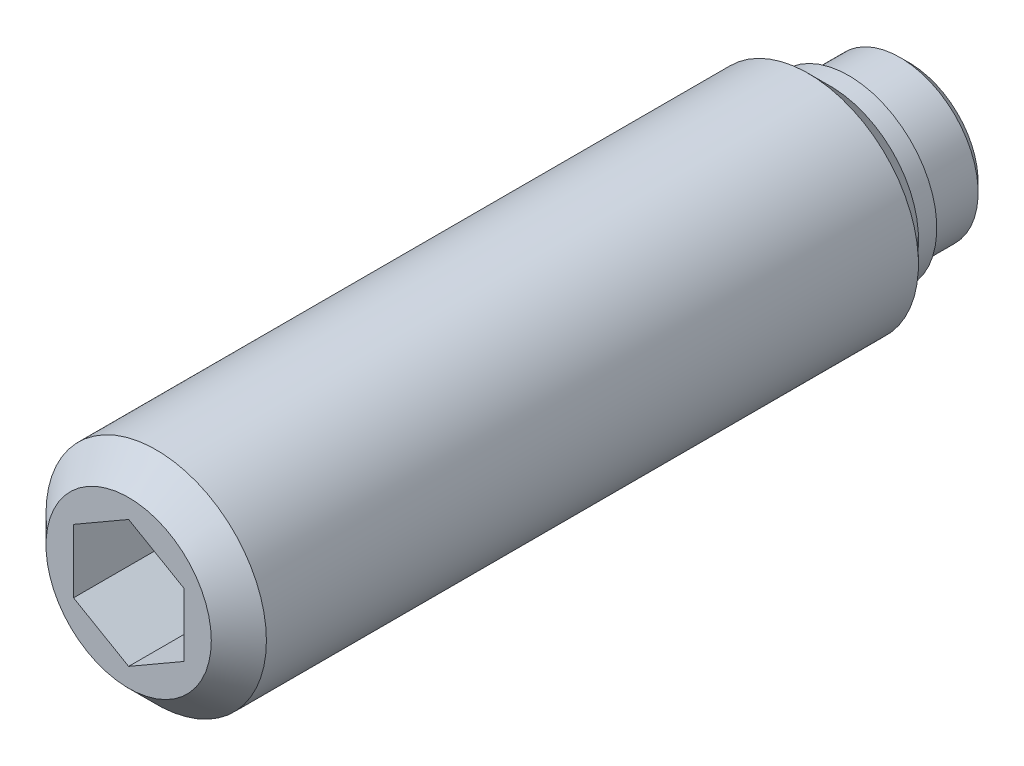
ISO-10303-21;
HEADER;
FILE_DESCRIPTION(('STEP AP214'),'2;1');
FILE_NAME('part.step','',(''),(''),'','','');
FILE_SCHEMA(('AUTOMOTIVE_DESIGN { 1 0 10303 214 1 1 1 1 }'));
ENDSEC;
DATA;
#1=APPLICATION_CONTEXT('core data for automotive mechanical design processes');
#2=APPLICATION_PROTOCOL_DEFINITION('international standard','automotive_design',2000,#1);
#3=PRODUCT_CONTEXT('',#1,'mechanical');
#4=PRODUCT('Part','Part','',(#3));
#5=PRODUCT_RELATED_PRODUCT_CATEGORY('part','',(#4));
#6=PRODUCT_DEFINITION_FORMATION('','',#4);
#7=PRODUCT_DEFINITION_CONTEXT('part definition',#1,'design');
#8=PRODUCT_DEFINITION('design','',#6,#7);
#9=PRODUCT_DEFINITION_SHAPE('','',#8);
#10=(LENGTH_UNIT() NAMED_UNIT(*) SI_UNIT(.MILLI.,.METRE.));
#11=(NAMED_UNIT(*) PLANE_ANGLE_UNIT() SI_UNIT($,.RADIAN.));
#12=(NAMED_UNIT(*) SI_UNIT($,.STERADIAN.) SOLID_ANGLE_UNIT());
#13=UNCERTAINTY_MEASURE_WITH_UNIT(LENGTH_MEASURE(1.E-05),#10,'distance_accuracy_value','');
#14=(GEOMETRIC_REPRESENTATION_CONTEXT(3) GLOBAL_UNCERTAINTY_ASSIGNED_CONTEXT((#13)) GLOBAL_UNIT_ASSIGNED_CONTEXT((#10,
#11,#12)) REPRESENTATION_CONTEXT('',''));
#15=CARTESIAN_POINT('',(0.,0.,0.));
#16=DIRECTION('',(0.,0.,1.));
#17=DIRECTION('',(1.,0.,0.));
#18=AXIS2_PLACEMENT_3D('',#15,#16,#17);
#19=CARTESIAN_POINT('',(0.,0.,3.3));
#20=DIRECTION('',(0.,0.,-1.));
#21=DIRECTION('',(-1.,0.,0.));
#22=AXIS2_PLACEMENT_3D('',#19,#20,#21);
#23=CYLINDRICAL_SURFACE('',#22,6.);
#24=CARTESIAN_POINT('',(0.,0.,5.5));
#25=DIRECTION('',(0.,0.,-1.));
#26=DIRECTION('',(-1.,0.,0.));
#27=AXIS2_PLACEMENT_3D('',#24,#25,#26);
#28=CIRCLE('',#27,6.);
#29=CARTESIAN_POINT('',(-6.,0.,5.5));
#30=VERTEX_POINT('',#29);
#31=EDGE_CURVE('E9',#30,#30,#28,.T.);
#32=ORIENTED_EDGE('',*,*,#31,.F.);
#33=EDGE_LOOP('',(#32));
#34=FACE_BOUND('',#33,.T.);
#35=CARTESIAN_POINT('',(0.,0.,41.));
#36=DIRECTION('',(0.,0.,1.));
#37=DIRECTION('',(1.,0.,0.));
#38=AXIS2_PLACEMENT_3D('',#35,#36,#37);
#39=CIRCLE('',#38,6.);
#40=CARTESIAN_POINT('',(6.,0.,41.));
#41=VERTEX_POINT('',#40);
#42=EDGE_CURVE('E123',#41,#41,#39,.T.);
#43=ORIENTED_EDGE('',*,*,#42,.F.);
#44=EDGE_LOOP('',(#43));
#45=FACE_BOUND('',#44,.T.);
#46=ADVANCED_FACE('F14',(#34,#45),#23,.T.);
#47=CARTESIAN_POINT('',(0.,0.,5.5));
#48=DIRECTION('',(0.,0.,1.));
#49=DIRECTION('',(1.,0.,0.));
#50=AXIS2_PLACEMENT_3D('',#47,#48,#49);
#51=CONICAL_SURFACE('',#50,6.,0.785398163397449);
#52=ORIENTED_EDGE('',*,*,#31,.T.);
#53=EDGE_LOOP('',(#52));
#54=FACE_BOUND('',#53,.T.);
#55=CARTESIAN_POINT('',(0.,0.,4.3));
#56=DIRECTION('',(0.,0.,-1.));
#57=DIRECTION('',(-1.,0.,0.));
#58=AXIS2_PLACEMENT_3D('',#55,#56,#57);
#59=CIRCLE('',#58,4.8);
#60=CARTESIAN_POINT('',(-4.8,0.,4.3));
#61=VERTEX_POINT('',#60);
#62=EDGE_CURVE('E21',#61,#61,#59,.T.);
#63=ORIENTED_EDGE('',*,*,#62,.F.);
#64=EDGE_LOOP('',(#63));
#65=FACE_BOUND('',#64,.T.);
#66=ADVANCED_FACE('F143',(#54,#65),#51,.T.);
#67=CARTESIAN_POINT('',(0.,0.,3.3));
#68=DIRECTION('',(0.,0.,-1.));
#69=DIRECTION('',(-1.,0.,0.));
#70=AXIS2_PLACEMENT_3D('',#67,#68,#69);
#71=CYLINDRICAL_SURFACE('',#70,4.8);
#72=ORIENTED_EDGE('',*,*,#62,.T.);
#73=EDGE_LOOP('',(#72));
#74=FACE_BOUND('',#73,.T.);
#75=CARTESIAN_POINT('',(0.,0.,3.3));
#76=DIRECTION('',(0.,0.,-1.));
#77=DIRECTION('',(-1.,0.,0.));
#78=AXIS2_PLACEMENT_3D('',#75,#76,#77);
#79=CIRCLE('',#78,4.8);
#80=CARTESIAN_POINT('',(-4.8,0.,3.3));
#81=VERTEX_POINT('',#80);
#82=EDGE_CURVE('E135',#81,#81,#79,.T.);
#83=ORIENTED_EDGE('',*,*,#82,.F.);
#84=EDGE_LOOP('',(#83));
#85=FACE_BOUND('',#84,.T.);
#86=ADVANCED_FACE('F140',(#74,#85),#71,.T.);
#87=CARTESIAN_POINT('',(0.,4.8,3.3));
#88=DIRECTION('',(0.,0.,1.));
#89=DIRECTION('',(1.,0.,0.));
#90=AXIS2_PLACEMENT_3D('',#87,#88,#89);
#91=PLANE('',#90);
#92=ORIENTED_EDGE('',*,*,#82,.T.);
#93=EDGE_LOOP('',(#92));
#94=FACE_BOUND('',#93,.T.);
#95=CARTESIAN_POINT('',(0.,0.,3.3));
#96=DIRECTION('',(0.,0.,-1.));
#97=DIRECTION('',(-1.,0.,0.));
#98=AXIS2_PLACEMENT_3D('',#95,#96,#97);
#99=CIRCLE('',#98,4.25);
#100=CARTESIAN_POINT('',(-4.25,0.,3.3));
#101=VERTEX_POINT('',#100);
#102=EDGE_CURVE('E132',#101,#101,#99,.T.);
#103=ORIENTED_EDGE('',*,*,#102,.F.);
#104=EDGE_LOOP('',(#103));
#105=FACE_BOUND('',#104,.T.);
#106=ADVANCED_FACE('F151',(#94,#105),#91,.F.);
#107=CARTESIAN_POINT('',(0.,0.,0.));
#108=DIRECTION('',(0.,0.,-1.));
#109=DIRECTION('',(-1.,0.,0.));
#110=AXIS2_PLACEMENT_3D('',#107,#108,#109);
#111=CYLINDRICAL_SURFACE('',#110,4.25);
#112=CARTESIAN_POINT('',(0.,0.,0.5));
#113=DIRECTION('',(0.,0.,-1.));
#114=DIRECTION('',(-1.,0.,0.));
#115=AXIS2_PLACEMENT_3D('',#112,#113,#114);
#116=CIRCLE('',#115,4.25);
#117=CARTESIAN_POINT('',(-4.25,0.,0.5));
#118=VERTEX_POINT('',#117);
#119=EDGE_CURVE('E129',#118,#118,#116,.T.);
#120=ORIENTED_EDGE('',*,*,#119,.F.);
#121=EDGE_LOOP('',(#120));
#122=FACE_BOUND('',#121,.T.);
#123=ORIENTED_EDGE('',*,*,#102,.T.);
#124=EDGE_LOOP('',(#123));
#125=FACE_BOUND('',#124,.T.);
#126=ADVANCED_FACE('F157',(#122,#125),#111,.T.);
#127=CARTESIAN_POINT('',(0.,0.,0.5));
#128=DIRECTION('',(0.,0.,1.));
#129=DIRECTION('',(1.,0.,0.));
#130=AXIS2_PLACEMENT_3D('',#127,#128,#129);
#131=CONICAL_SURFACE('',#130,4.25,0.785398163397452);
#132=CARTESIAN_POINT('',(0.,0.,0.));
#133=DIRECTION('',(0.,0.,-1.));
#134=DIRECTION('',(-1.,0.,0.));
#135=AXIS2_PLACEMENT_3D('',#132,#133,#134);
#136=CIRCLE('',#135,3.75);
#137=CARTESIAN_POINT('',(-3.75,0.,0.));
#138=VERTEX_POINT('',#137);
#139=EDGE_CURVE('E126',#138,#138,#136,.T.);
#140=ORIENTED_EDGE('',*,*,#139,.F.);
#141=EDGE_LOOP('',(#140));
#142=FACE_BOUND('',#141,.T.);
#143=ORIENTED_EDGE('',*,*,#119,.T.);
#144=EDGE_LOOP('',(#143));
#145=FACE_BOUND('',#144,.T.);
#146=ADVANCED_FACE('F161',(#142,#145),#131,.T.);
#147=CARTESIAN_POINT('',(0.,3.75,0.));
#148=DIRECTION('',(0.,0.,1.));
#149=DIRECTION('',(1.,0.,0.));
#150=AXIS2_PLACEMENT_3D('',#147,#148,#149);
#151=PLANE('',#150);
#152=ORIENTED_EDGE('',*,*,#139,.T.);
#153=EDGE_LOOP('',(#152));
#154=FACE_BOUND('',#153,.T.);
#155=ADVANCED_FACE('F165',(#154),#151,.F.);
#156=CARTESIAN_POINT('',(0.,0.,42.5));
#157=DIRECTION('',(0.,0.,-1.));
#158=DIRECTION('',(-1.,0.,0.));
#159=AXIS2_PLACEMENT_3D('',#156,#157,#158);
#160=CONICAL_SURFACE('',#159,4.5,0.78539816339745);
#161=ORIENTED_EDGE('',*,*,#42,.T.);
#162=EDGE_LOOP('',(#161));
#163=FACE_BOUND('',#162,.T.);
#164=CARTESIAN_POINT('',(0.,0.,42.5));
#165=DIRECTION('',(0.,0.,1.));
#166=DIRECTION('',(1.,0.,0.));
#167=AXIS2_PLACEMENT_3D('',#164,#165,#166);
#168=CIRCLE('',#167,4.5);
#169=CARTESIAN_POINT('',(4.5,0.,42.5));
#170=VERTEX_POINT('',#169);
#171=EDGE_CURVE('E115',#170,#170,#168,.T.);
#172=ORIENTED_EDGE('',*,*,#171,.F.);
#173=EDGE_LOOP('',(#172));
#174=FACE_BOUND('',#173,.T.);
#175=ADVANCED_FACE('F169',(#163,#174),#160,.T.);
#176=CARTESIAN_POINT('',(0.,-4.5,42.5));
#177=DIRECTION('',(0.,0.,1.));
#178=DIRECTION('',(1.,0.,0.));
#179=AXIS2_PLACEMENT_3D('',#176,#177,#178);
#180=PLANE('',#179);
#181=DIRECTION('',(0.866025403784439,-0.5,0.));
#182=VECTOR('',#181,1.);
#183=CARTESIAN_POINT('',(-3.,-1.73205080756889,42.5));
#184=LINE('',#183,#182);
#185=CARTESIAN_POINT('',(-3.,-1.73205080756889,42.5));
#186=VERTEX_POINT('',#185);
#187=CARTESIAN_POINT('',(0.,-3.46410161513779,42.5));
#188=VERTEX_POINT('',#187);
#189=EDGE_CURVE('E28',#186,#188,#184,.T.);
#190=ORIENTED_EDGE('',*,*,#189,.F.);
#191=DIRECTION('',(0.,-1.,0.));
#192=VECTOR('',#191,1.);
#193=CARTESIAN_POINT('',(-3.,1.73205080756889,42.5));
#194=LINE('',#193,#192);
#195=CARTESIAN_POINT('',(-3.,1.73205080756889,42.5));
#196=VERTEX_POINT('',#195);
#197=EDGE_CURVE('E111',#196,#186,#194,.T.);
#198=ORIENTED_EDGE('',*,*,#197,.F.);
#199=DIRECTION('',(-0.866025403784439,-0.5,0.));
#200=VECTOR('',#199,1.);
#201=CARTESIAN_POINT('',(0.,3.46410161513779,42.5));
#202=LINE('',#201,#200);
#203=CARTESIAN_POINT('',(0.,3.46410161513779,42.5));
#204=VERTEX_POINT('',#203);
#205=EDGE_CURVE('E109',#204,#196,#202,.T.);
#206=ORIENTED_EDGE('',*,*,#205,.F.);
#207=DIRECTION('',(-0.866025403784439,0.5,0.));
#208=VECTOR('',#207,1.);
#209=CARTESIAN_POINT('',(3.,1.73205080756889,42.5));
#210=LINE('',#209,#208);
#211=CARTESIAN_POINT('',(3.,1.73205080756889,42.5));
#212=VERTEX_POINT('',#211);
#213=EDGE_CURVE('E76',#212,#204,#210,.T.);
#214=ORIENTED_EDGE('',*,*,#213,.F.);
#215=DIRECTION('',(0.,1.,0.));
#216=VECTOR('',#215,1.);
#217=CARTESIAN_POINT('',(3.,-1.73205080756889,42.5));
#218=LINE('',#217,#216);
#219=CARTESIAN_POINT('',(3.,-1.73205080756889,42.5));
#220=VERTEX_POINT('',#219);
#221=EDGE_CURVE('E105',#220,#212,#218,.T.);
#222=ORIENTED_EDGE('',*,*,#221,.F.);
#223=DIRECTION('',(0.866025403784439,0.5,0.));
#224=VECTOR('',#223,1.);
#225=CARTESIAN_POINT('',(0.,-3.46410161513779,42.5));
#226=LINE('',#225,#224);
#227=EDGE_CURVE('E102',#188,#220,#226,.T.);
#228=ORIENTED_EDGE('',*,*,#227,.F.);
#229=EDGE_LOOP('',(#190,#198,#206,#214,#222,#228));
#230=FACE_BOUND('',#229,.T.);
#231=ORIENTED_EDGE('',*,*,#171,.T.);
#232=EDGE_LOOP('',(#231));
#233=FACE_BOUND('',#232,.T.);
#234=ADVANCED_FACE('F173',(#230,#233),#180,.T.);
#235=CARTESIAN_POINT('',(-3.,-1.73205080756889,34.5));
#236=DIRECTION('',(-0.5,-0.866025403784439,0.));
#237=DIRECTION('',(0.866025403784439,-0.5,0.));
#238=AXIS2_PLACEMENT_3D('',#235,#236,#237);
#239=PLANE('',#238);
#240=ORIENTED_EDGE('',*,*,#189,.T.);
#241=DIRECTION('',(0.,0.,1.));
#242=VECTOR('',#241,1.);
#243=CARTESIAN_POINT('',(0.,-3.46410161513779,34.5));
#244=LINE('',#243,#242);
#245=CARTESIAN_POINT('',(0.,-3.46410161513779,34.5));
#246=VERTEX_POINT('',#245);
#247=EDGE_CURVE('E58',#246,#188,#244,.T.);
#248=ORIENTED_EDGE('',*,*,#247,.F.);
#249=DIRECTION('',(0.866025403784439,-0.5,0.));
#250=VECTOR('',#249,1.);
#251=CARTESIAN_POINT('',(-3.,-1.73205080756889,34.5));
#252=LINE('',#251,#250);
#253=CARTESIAN_POINT('',(-3.,-1.73205080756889,34.5));
#254=VERTEX_POINT('',#253);
#255=EDGE_CURVE('E113',#254,#246,#252,.T.);
#256=ORIENTED_EDGE('',*,*,#255,.F.);
#257=DIRECTION('',(0.,0.,1.));
#258=VECTOR('',#257,1.);
#259=CARTESIAN_POINT('',(-3.,-1.73205080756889,34.5));
#260=LINE('',#259,#258);
#261=EDGE_CURVE('E36',#254,#186,#260,.T.);
#262=ORIENTED_EDGE('',*,*,#261,.T.);
#263=EDGE_LOOP('',(#240,#248,#256,#262));
#264=FACE_BOUND('',#263,.T.);
#265=ADVANCED_FACE('F177',(#264),#239,.F.);
#266=CARTESIAN_POINT('',(-3.,1.73205080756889,34.5));
#267=DIRECTION('',(-1.,0.,0.));
#268=DIRECTION('',(0.,0.,1.));
#269=AXIS2_PLACEMENT_3D('',#266,#267,#268);
#270=PLANE('',#269);
#271=ORIENTED_EDGE('',*,*,#197,.T.);
#272=ORIENTED_EDGE('',*,*,#261,.F.);
#273=DIRECTION('',(0.,-1.,0.));
#274=VECTOR('',#273,1.);
#275=CARTESIAN_POINT('',(-3.,1.73205080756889,34.5));
#276=LINE('',#275,#274);
#277=CARTESIAN_POINT('',(-3.,1.73205080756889,34.5));
#278=VERTEX_POINT('',#277);
#279=EDGE_CURVE('E88',#278,#254,#276,.T.);
#280=ORIENTED_EDGE('',*,*,#279,.F.);
#281=DIRECTION('',(0.,0.,1.));
#282=VECTOR('',#281,1.);
#283=CARTESIAN_POINT('',(-3.,1.73205080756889,34.5));
#284=LINE('',#283,#282);
#285=EDGE_CURVE('E80',#278,#196,#284,.T.);
#286=ORIENTED_EDGE('',*,*,#285,.T.);
#287=EDGE_LOOP('',(#271,#272,#280,#286));
#288=FACE_BOUND('',#287,.T.);
#289=ADVANCED_FACE('F181',(#288),#270,.F.);
#290=CARTESIAN_POINT('',(0.,3.46410161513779,34.5));
#291=DIRECTION('',(-0.5,0.866025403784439,0.));
#292=DIRECTION('',(-0.866025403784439,-0.5,0.));
#293=AXIS2_PLACEMENT_3D('',#290,#291,#292);
#294=PLANE('',#293);
#295=ORIENTED_EDGE('',*,*,#205,.T.);
#296=ORIENTED_EDGE('',*,*,#285,.F.);
#297=DIRECTION('',(-0.866025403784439,-0.5,0.));
#298=VECTOR('',#297,1.);
#299=CARTESIAN_POINT('',(0.,3.46410161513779,34.5));
#300=LINE('',#299,#298);
#301=CARTESIAN_POINT('',(0.,3.46410161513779,34.5));
#302=VERTEX_POINT('',#301);
#303=EDGE_CURVE('E84',#302,#278,#300,.T.);
#304=ORIENTED_EDGE('',*,*,#303,.F.);
#305=DIRECTION('',(0.,0.,1.));
#306=VECTOR('',#305,1.);
#307=CARTESIAN_POINT('',(0.,3.46410161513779,34.5));
#308=LINE('',#307,#306);
#309=EDGE_CURVE('E69',#302,#204,#308,.T.);
#310=ORIENTED_EDGE('',*,*,#309,.T.);
#311=EDGE_LOOP('',(#295,#296,#304,#310));
#312=FACE_BOUND('',#311,.T.);
#313=ADVANCED_FACE('F85',(#312),#294,.F.);
#314=CARTESIAN_POINT('',(3.,1.73205080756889,34.5));
#315=DIRECTION('',(0.5,0.866025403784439,0.));
#316=DIRECTION('',(-0.866025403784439,0.5,0.));
#317=AXIS2_PLACEMENT_3D('',#314,#315,#316);
#318=PLANE('',#317);
#319=ORIENTED_EDGE('',*,*,#213,.T.);
#320=ORIENTED_EDGE('',*,*,#309,.F.);
#321=DIRECTION('',(-0.866025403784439,0.5,0.));
#322=VECTOR('',#321,1.);
#323=CARTESIAN_POINT('',(3.,1.73205080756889,34.5));
#324=LINE('',#323,#322);
#325=CARTESIAN_POINT('',(3.,1.73205080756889,34.5));
#326=VERTEX_POINT('',#325);
#327=EDGE_CURVE('E73',#326,#302,#324,.T.);
#328=ORIENTED_EDGE('',*,*,#327,.F.);
#329=DIRECTION('',(0.,0.,1.));
#330=VECTOR('',#329,1.);
#331=CARTESIAN_POINT('',(3.,1.73205080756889,34.5));
#332=LINE('',#331,#330);
#333=EDGE_CURVE('E81',#326,#212,#332,.T.);
#334=ORIENTED_EDGE('',*,*,#333,.T.);
#335=EDGE_LOOP('',(#319,#320,#328,#334));
#336=FACE_BOUND('',#335,.T.);
#337=ADVANCED_FACE('F71',(#336),#318,.F.);
#338=CARTESIAN_POINT('',(3.,-1.73205080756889,34.5));
#339=DIRECTION('',(1.,0.,0.));
#340=DIRECTION('',(0.,0.,-1.));
#341=AXIS2_PLACEMENT_3D('',#338,#339,#340);
#342=PLANE('',#341);
#343=ORIENTED_EDGE('',*,*,#221,.T.);
#344=ORIENTED_EDGE('',*,*,#333,.F.);
#345=DIRECTION('',(0.,1.,0.));
#346=VECTOR('',#345,1.);
#347=CARTESIAN_POINT('',(3.,-1.73205080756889,34.5));
#348=LINE('',#347,#346);
#349=CARTESIAN_POINT('',(3.,-1.73205080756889,34.5));
#350=VERTEX_POINT('',#349);
#351=EDGE_CURVE('E94',#350,#326,#348,.T.);
#352=ORIENTED_EDGE('',*,*,#351,.F.);
#353=DIRECTION('',(0.,0.,1.));
#354=VECTOR('',#353,1.);
#355=CARTESIAN_POINT('',(3.,-1.73205080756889,34.5));
#356=LINE('',#355,#354);
#357=EDGE_CURVE('E118',#350,#220,#356,.T.);
#358=ORIENTED_EDGE('',*,*,#357,.T.);
#359=EDGE_LOOP('',(#343,#344,#352,#358));
#360=FACE_BOUND('',#359,.T.);
#361=ADVANCED_FACE('F185',(#360),#342,.F.);
#362=CARTESIAN_POINT('',(0.,-3.46410161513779,34.5));
#363=DIRECTION('',(0.5,-0.866025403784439,0.));
#364=DIRECTION('',(0.866025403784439,0.5,0.));
#365=AXIS2_PLACEMENT_3D('',#362,#363,#364);
#366=PLANE('',#365);
#367=ORIENTED_EDGE('',*,*,#227,.T.);
#368=ORIENTED_EDGE('',*,*,#357,.F.);
#369=DIRECTION('',(0.866025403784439,0.5,0.));
#370=VECTOR('',#369,1.);
#371=CARTESIAN_POINT('',(0.,-3.46410161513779,34.5));
#372=LINE('',#371,#370);
#373=EDGE_CURVE('E96',#246,#350,#372,.T.);
#374=ORIENTED_EDGE('',*,*,#373,.F.);
#375=ORIENTED_EDGE('',*,*,#247,.T.);
#376=EDGE_LOOP('',(#367,#368,#374,#375));
#377=FACE_BOUND('',#376,.T.);
#378=ADVANCED_FACE('F182',(#377),#366,.F.);
#379=CARTESIAN_POINT('',(0.,0.,34.5));
#380=DIRECTION('',(0.,0.,1.));
#381=DIRECTION('',(1.,0.,0.));
#382=AXIS2_PLACEMENT_3D('',#379,#380,#381);
#383=PLANE('',#382);
#384=ORIENTED_EDGE('',*,*,#255,.T.);
#385=ORIENTED_EDGE('',*,*,#373,.T.);
#386=ORIENTED_EDGE('',*,*,#351,.T.);
#387=ORIENTED_EDGE('',*,*,#327,.T.);
#388=ORIENTED_EDGE('',*,*,#303,.T.);
#389=ORIENTED_EDGE('',*,*,#279,.T.);
#390=EDGE_LOOP('',(#384,#385,#386,#387,#388,#389));
#391=FACE_BOUND('',#390,.T.);
#392=ADVANCED_FACE('F91',(#391),#383,.T.);
#393=CLOSED_SHELL('',(#46,#66,#86,#106,#126,#146,#155,#175,#234,#265,#289,#313,#337,#361,#378,#392));
#394=MANIFOLD_SOLID_BREP('B1',#393);
#395=ADVANCED_BREP_SHAPE_REPRESENTATION('',(#18,#394),#14);
#396=SHAPE_DEFINITION_REPRESENTATION(#9,#395);
ENDSEC;
END-ISO-10303-21;
